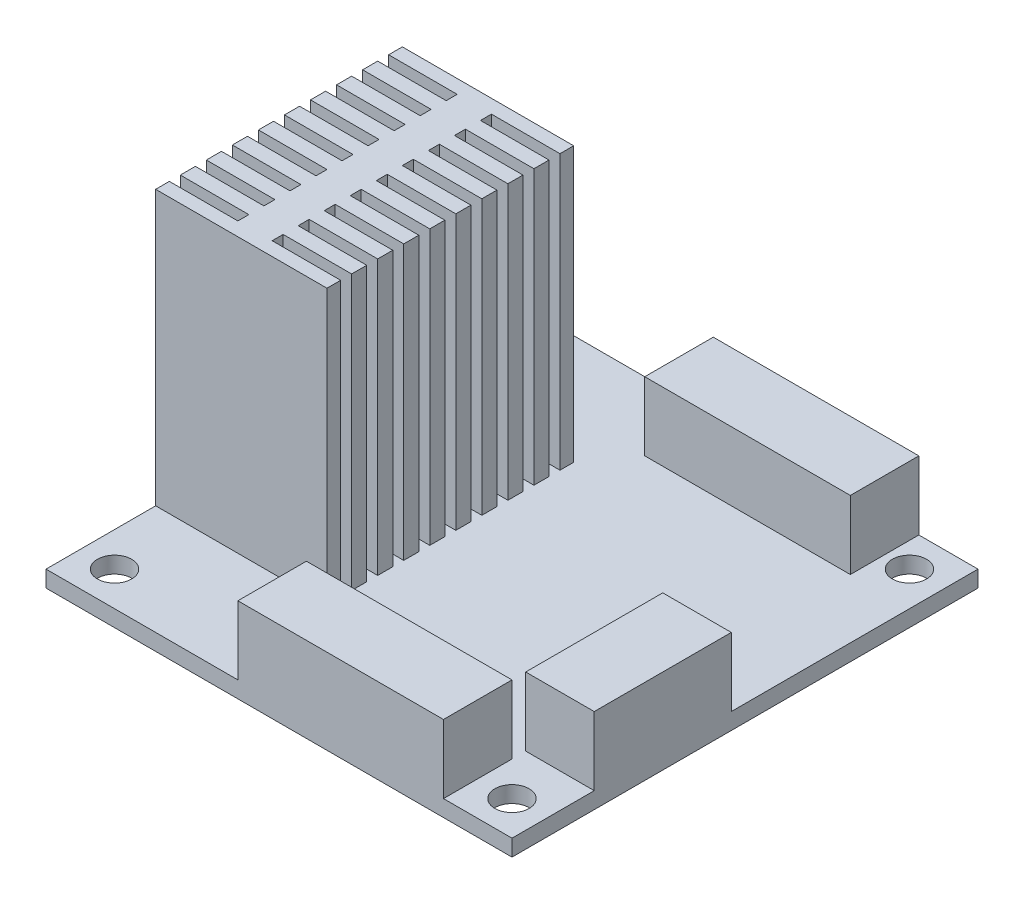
from build123d import *

# Parameters (mm, degrees)
SKETCH2_W           = 43.18
SKETCH2_H           = 43.18
BOSS_EXTRUDE1_DEPTH = 1.524
BOSS_EXTRUDE2_DEPTH = 25.4
SKETCH4_W           = 19.05
SKETCH4_H           = 6.35
SKETCH4_W_2         = 6.35
SKETCH4_H_2         = 12.7
BOSS_EXTRUDE4_DEPTH = 6.35
SKETCH5_R           = 1.5875
CUT_EXTRUDE1_DEPTH  = 6.35


with BuildPart() as part:
    # Sketch2 → Boss-Extrude1 (new body)
    with BuildSketch(Plane(origin=(0, 0, 0), x_dir=(1, 0, 0), z_dir=(0, 1, 0))):
        with Locations((21.59, 21.59)):
            Rectangle(SKETCH2_W, SKETCH2_H)
    extrude(amount=BOSS_EXTRUDE1_DEPTH)

    # Sketch3 → Boss-Extrude2 (add)
    with BuildSketch(Plane(origin=(0, 1.524, 0), x_dir=(1, 0, 0), z_dir=(0, 1, 0))):
        Polygon((0, 10.16), (15.875, 10.16), (15.875, 11.43), (9.525, 11.43), (9.525, 12.446), (15.875, 12.446), (15.875, 13.843), (9.525, 13.843), (9.525, 14.859), (15.875, 14.859), (15.875, 16.256), (9.525, 16.256), (9.525, 17.272), (15.875, 17.272), (15.875, 18.669), (9.525, 18.669), (9.525, 19.685), (15.875, 19.685), (15.875, 21.082), (9.525, 21.082), (9.525, 22.098), (15.875, 22.098), (15.875, 23.495), (9.525, 23.495), (9.525, 24.511), (15.875, 24.511), (15.875, 25.908), (9.525, 25.908), (9.525, 26.924), (15.875, 26.924), (15.875, 28.321), (9.525, 28.321), (9.525, 29.337), (15.875, 29.337), (15.875, 30.734), (9.525, 30.734), (9.525, 31.75), (15.875, 31.75), (15.875, 33.02), (0, 33.02), (0, 31.75), (6.35, 31.75), (6.35, 30.734), (0, 30.734), (0, 29.337), (6.35, 29.337), (6.35, 28.321), (0, 28.321), (0, 26.924), (6.35, 26.924), (6.35, 25.908), (0, 25.908), (0, 24.511), (6.35, 24.511), (6.35, 23.495), (0, 23.495), (0, 22.098), (6.35, 22.098), (6.35, 21.082), (0, 21.082), (0, 19.685), (6.35, 19.685), (6.35, 18.669), (0, 18.669), (0, 17.272), (6.35, 17.272), (6.35, 16.256), (0, 16.256), (0, 14.859), (6.35, 14.859), (6.35, 13.843), (0, 13.843), (0, 12.446), (6.35, 12.446), (6.35, 11.43), (0, 11.43), align=None)
    extrude(amount=BOSS_EXTRUDE2_DEPTH)

    # Sketch4 → Boss-Extrude4 (add)
    with BuildSketch(Plane(origin=(0, 1.524, 0), x_dir=(1, 0, 0), z_dir=(0, 1, 0))):
        with Locations((27.305, 3.175)):
            Rectangle(SKETCH4_W, SKETCH4_H)
        with Locations((28.175398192, 40.005)):
            Rectangle(SKETCH4_W, SKETCH4_H)
        with Locations((40.005, 13.97)):
            Rectangle(SKETCH4_W_2, SKETCH4_H_2)
    extrude(amount=BOSS_EXTRUDE4_DEPTH)

    # Sketch5 → Cut-Extrude1 (cut)
    with BuildSketch(Plane(origin=(0, 1.524, 0), x_dir=(1, 0, 0), z_dir=(0, 1, 0))):
        with Locations(Location((3.175, 40.005, 0), (0, 0, 270))):
            Circle(SKETCH5_R)
        with Locations(Location((40.005, 40.005, 0), (0, 0, 270))):
            Circle(SKETCH5_R)
        with Locations(Location((40.005, 3.175, 0), (0, 0, 270))):
            Circle(SKETCH5_R)
        with Locations(Location((3.175, 3.175, 0), (0, 0, 270))):
            Circle(SKETCH5_R)
    extrude(amount=-CUT_EXTRUDE1_DEPTH, mode=Mode.SUBTRACT)


solid = part.part
